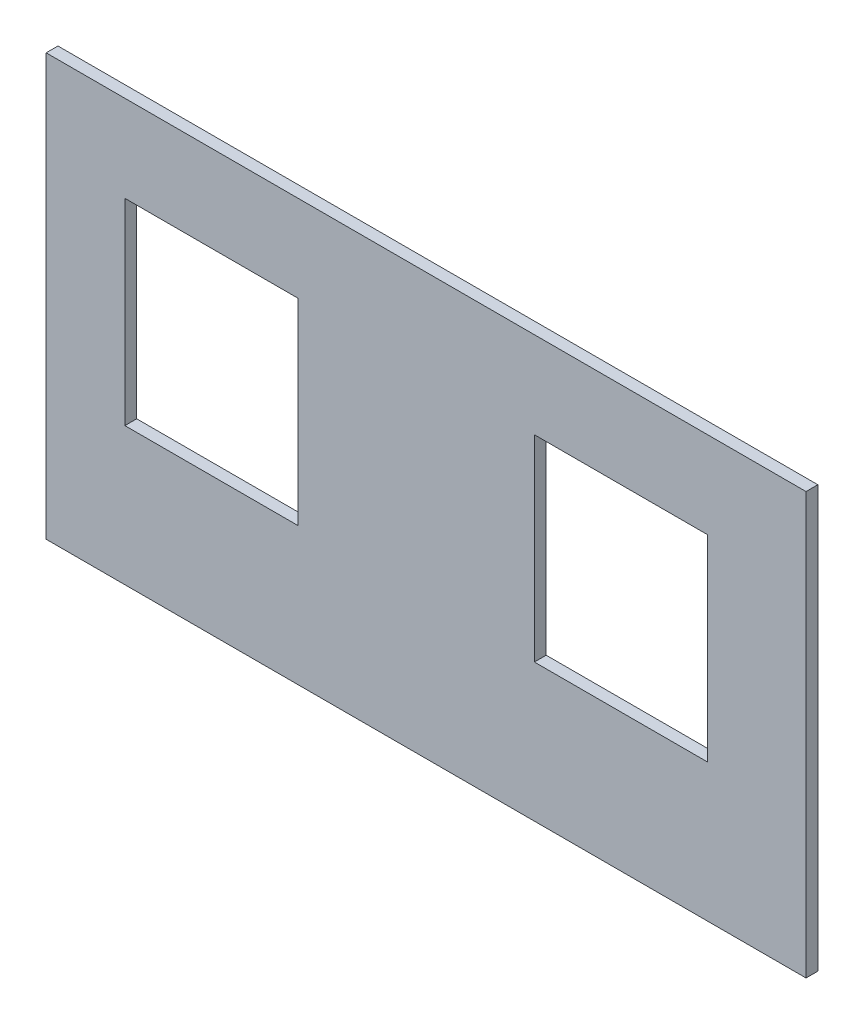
ISO-10303-21;
HEADER;
FILE_DESCRIPTION(('STEP AP214'),'2;1');
FILE_NAME('part.step','',(''),(''),'','','');
FILE_SCHEMA(('AUTOMOTIVE_DESIGN { 1 0 10303 214 1 1 1 1 }'));
ENDSEC;
DATA;
#1=APPLICATION_CONTEXT('core data for automotive mechanical design processes');
#2=APPLICATION_PROTOCOL_DEFINITION('international standard','automotive_design',2000,#1);
#3=PRODUCT_CONTEXT('',#1,'mechanical');
#4=PRODUCT('Part','Part','',(#3));
#5=PRODUCT_RELATED_PRODUCT_CATEGORY('part','',(#4));
#6=PRODUCT_DEFINITION_FORMATION('','',#4);
#7=PRODUCT_DEFINITION_CONTEXT('part definition',#1,'design');
#8=PRODUCT_DEFINITION('design','',#6,#7);
#9=PRODUCT_DEFINITION_SHAPE('','',#8);
#10=(LENGTH_UNIT() NAMED_UNIT(*) SI_UNIT(.MILLI.,.METRE.));
#11=(NAMED_UNIT(*) PLANE_ANGLE_UNIT() SI_UNIT($,.RADIAN.));
#12=(NAMED_UNIT(*) SI_UNIT($,.STERADIAN.) SOLID_ANGLE_UNIT());
#13=UNCERTAINTY_MEASURE_WITH_UNIT(LENGTH_MEASURE(1.E-05),#10,'distance_accuracy_value','');
#14=(GEOMETRIC_REPRESENTATION_CONTEXT(3) GLOBAL_UNCERTAINTY_ASSIGNED_CONTEXT((#13)) GLOBAL_UNIT_ASSIGNED_CONTEXT((#10,
#11,#12)) REPRESENTATION_CONTEXT('',''));
#15=CARTESIAN_POINT('',(0.,0.,0.));
#16=DIRECTION('',(0.,0.,1.));
#17=DIRECTION('',(1.,0.,0.));
#18=AXIS2_PLACEMENT_3D('',#15,#16,#17);
#19=CARTESIAN_POINT('',(0.,0.,3.));
#20=DIRECTION('',(1.,0.,0.));
#21=DIRECTION('',(0.,0.,-1.));
#22=AXIS2_PLACEMENT_3D('',#19,#20,#21);
#23=PLANE('',#22);
#24=DIRECTION('',(0.,-1.,0.));
#25=VECTOR('',#24,1.);
#26=CARTESIAN_POINT('',(0.,0.,0.));
#27=LINE('',#26,#25);
#28=CARTESIAN_POINT('',(0.,107.,0.));
#29=VERTEX_POINT('',#28);
#30=CARTESIAN_POINT('',(0.,0.,0.));
#31=VERTEX_POINT('',#30);
#32=EDGE_CURVE('E181',#29,#31,#27,.T.);
#33=ORIENTED_EDGE('',*,*,#32,.T.);
#34=DIRECTION('',(0.,0.,-1.));
#35=VECTOR('',#34,1.);
#36=CARTESIAN_POINT('',(0.,0.,3.));
#37=LINE('',#36,#35);
#38=CARTESIAN_POINT('',(0.,0.,3.));
#39=VERTEX_POINT('',#38);
#40=EDGE_CURVE('E11',#39,#31,#37,.T.);
#41=ORIENTED_EDGE('',*,*,#40,.F.);
#42=DIRECTION('',(0.,-1.,0.));
#43=VECTOR('',#42,1.);
#44=CARTESIAN_POINT('',(0.,0.,3.));
#45=LINE('',#44,#43);
#46=CARTESIAN_POINT('',(0.,107.,3.));
#47=VERTEX_POINT('',#46);
#48=EDGE_CURVE('E188',#47,#39,#45,.T.);
#49=ORIENTED_EDGE('',*,*,#48,.F.);
#50=DIRECTION('',(0.,0.,-1.));
#51=VECTOR('',#50,1.);
#52=CARTESIAN_POINT('',(0.,107.,3.));
#53=LINE('',#52,#51);
#54=EDGE_CURVE('E198',#47,#29,#53,.T.);
#55=ORIENTED_EDGE('',*,*,#54,.T.);
#56=EDGE_LOOP('',(#33,#41,#49,#55));
#57=FACE_BOUND('',#56,.T.);
#58=ADVANCED_FACE('F31',(#57),#23,.F.);
#59=CARTESIAN_POINT('',(0.,0.,3.));
#60=DIRECTION('',(0.,1.,0.));
#61=DIRECTION('',(0.,0.,1.));
#62=AXIS2_PLACEMENT_3D('',#59,#60,#61);
#63=PLANE('',#62);
#64=DIRECTION('',(1.,0.,0.));
#65=VECTOR('',#64,1.);
#66=CARTESIAN_POINT('',(0.,0.,0.));
#67=LINE('',#66,#65);
#68=CARTESIAN_POINT('',(193.,0.,0.));
#69=VERTEX_POINT('',#68);
#70=EDGE_CURVE('E201',#31,#69,#67,.T.);
#71=ORIENTED_EDGE('',*,*,#70,.T.);
#72=DIRECTION('',(0.,0.,-1.));
#73=VECTOR('',#72,1.);
#74=CARTESIAN_POINT('',(193.,0.,3.));
#75=LINE('',#74,#73);
#76=CARTESIAN_POINT('',(193.,0.,3.));
#77=VERTEX_POINT('',#76);
#78=EDGE_CURVE('E38',#77,#69,#75,.T.);
#79=ORIENTED_EDGE('',*,*,#78,.F.);
#80=DIRECTION('',(1.,0.,0.));
#81=VECTOR('',#80,1.);
#82=CARTESIAN_POINT('',(0.,0.,3.));
#83=LINE('',#82,#81);
#84=EDGE_CURVE('E191',#39,#77,#83,.T.);
#85=ORIENTED_EDGE('',*,*,#84,.F.);
#86=ORIENTED_EDGE('',*,*,#40,.T.);
#87=EDGE_LOOP('',(#71,#79,#85,#86));
#88=FACE_BOUND('',#87,.T.);
#89=ADVANCED_FACE('F230',(#88),#63,.F.);
#90=CARTESIAN_POINT('',(193.,0.,3.));
#91=DIRECTION('',(-1.,0.,0.));
#92=DIRECTION('',(0.,0.,1.));
#93=AXIS2_PLACEMENT_3D('',#90,#91,#92);
#94=PLANE('',#93);
#95=DIRECTION('',(0.,1.,0.));
#96=VECTOR('',#95,1.);
#97=CARTESIAN_POINT('',(193.,0.,0.));
#98=LINE('',#97,#96);
#99=CARTESIAN_POINT('',(193.,107.,0.));
#100=VERTEX_POINT('',#99);
#101=EDGE_CURVE('E203',#69,#100,#98,.T.);
#102=ORIENTED_EDGE('',*,*,#101,.T.);
#103=DIRECTION('',(0.,0.,-1.));
#104=VECTOR('',#103,1.);
#105=CARTESIAN_POINT('',(193.,107.,3.));
#106=LINE('',#105,#104);
#107=CARTESIAN_POINT('',(193.,107.,3.));
#108=VERTEX_POINT('',#107);
#109=EDGE_CURVE('E208',#108,#100,#106,.T.);
#110=ORIENTED_EDGE('',*,*,#109,.F.);
#111=DIRECTION('',(0.,1.,0.));
#112=VECTOR('',#111,1.);
#113=CARTESIAN_POINT('',(193.,0.,3.));
#114=LINE('',#113,#112);
#115=EDGE_CURVE('E194',#77,#108,#114,.T.);
#116=ORIENTED_EDGE('',*,*,#115,.F.);
#117=ORIENTED_EDGE('',*,*,#78,.T.);
#118=EDGE_LOOP('',(#102,#110,#116,#117));
#119=FACE_BOUND('',#118,.T.);
#120=ADVANCED_FACE('F215',(#119),#94,.F.);
#121=CARTESIAN_POINT('',(0.,107.,3.));
#122=DIRECTION('',(0.,-1.,0.));
#123=DIRECTION('',(0.,0.,-1.));
#124=AXIS2_PLACEMENT_3D('',#121,#122,#123);
#125=PLANE('',#124);
#126=DIRECTION('',(-1.,0.,0.));
#127=VECTOR('',#126,1.);
#128=CARTESIAN_POINT('',(0.,107.,0.));
#129=LINE('',#128,#127);
#130=EDGE_CURVE('E192',#100,#29,#129,.T.);
#131=ORIENTED_EDGE('',*,*,#130,.T.);
#132=ORIENTED_EDGE('',*,*,#54,.F.);
#133=DIRECTION('',(-1.,0.,0.));
#134=VECTOR('',#133,1.);
#135=CARTESIAN_POINT('',(0.,107.,3.));
#136=LINE('',#135,#134);
#137=EDGE_CURVE('E196',#108,#47,#136,.T.);
#138=ORIENTED_EDGE('',*,*,#137,.F.);
#139=ORIENTED_EDGE('',*,*,#109,.T.);
#140=EDGE_LOOP('',(#131,#132,#138,#139));
#141=FACE_BOUND('',#140,.T.);
#142=ADVANCED_FACE('F223',(#141),#125,.F.);
#143=CARTESIAN_POINT('',(0.,107.,3.));
#144=DIRECTION('',(0.,0.,-1.));
#145=DIRECTION('',(-1.,0.,0.));
#146=AXIS2_PLACEMENT_3D('',#143,#144,#145);
#147=PLANE('',#146);
#148=DIRECTION('',(1.,0.,0.));
#149=VECTOR('',#148,1.);
#150=CARTESIAN_POINT('',(124.,35.,3.));
#151=LINE('',#150,#149);
#152=CARTESIAN_POINT('',(124.,35.,3.));
#153=VERTEX_POINT('',#152);
#154=CARTESIAN_POINT('',(168.,35.,3.));
#155=VERTEX_POINT('',#154);
#156=EDGE_CURVE('E146',#153,#155,#151,.T.);
#157=ORIENTED_EDGE('',*,*,#156,.F.);
#158=DIRECTION('',(0.,-1.,0.));
#159=VECTOR('',#158,1.);
#160=CARTESIAN_POINT('',(124.,35.,3.));
#161=LINE('',#160,#159);
#162=CARTESIAN_POINT('',(124.,85.,3.));
#163=VERTEX_POINT('',#162);
#164=EDGE_CURVE('E45',#163,#153,#161,.T.);
#165=ORIENTED_EDGE('',*,*,#164,.F.);
#166=DIRECTION('',(-1.,0.,0.));
#167=VECTOR('',#166,1.);
#168=CARTESIAN_POINT('',(124.,85.,3.));
#169=LINE('',#168,#167);
#170=CARTESIAN_POINT('',(168.,85.,3.));
#171=VERTEX_POINT('',#170);
#172=EDGE_CURVE('E137',#171,#163,#169,.T.);
#173=ORIENTED_EDGE('',*,*,#172,.F.);
#174=DIRECTION('',(0.,1.,0.));
#175=VECTOR('',#174,1.);
#176=CARTESIAN_POINT('',(168.,35.,3.));
#177=LINE('',#176,#175);
#178=EDGE_CURVE('E140',#155,#171,#177,.T.);
#179=ORIENTED_EDGE('',*,*,#178,.F.);
#180=EDGE_LOOP('',(#157,#165,#173,#179));
#181=FACE_BOUND('',#180,.T.);
#182=DIRECTION('',(1.,0.,0.));
#183=VECTOR('',#182,1.);
#184=CARTESIAN_POINT('',(20.,35.,3.));
#185=LINE('',#184,#183);
#186=CARTESIAN_POINT('',(20.,35.,3.));
#187=VERTEX_POINT('',#186);
#188=CARTESIAN_POINT('',(64.,35.,3.));
#189=VERTEX_POINT('',#188);
#190=EDGE_CURVE('E171',#187,#189,#185,.T.);
#191=ORIENTED_EDGE('',*,*,#190,.F.);
#192=DIRECTION('',(0.,-1.,0.));
#193=VECTOR('',#192,1.);
#194=CARTESIAN_POINT('',(20.,35.,3.));
#195=LINE('',#194,#193);
#196=CARTESIAN_POINT('',(20.,85.,3.));
#197=VERTEX_POINT('',#196);
#198=EDGE_CURVE('E152',#197,#187,#195,.T.);
#199=ORIENTED_EDGE('',*,*,#198,.F.);
#200=DIRECTION('',(-1.,0.,0.));
#201=VECTOR('',#200,1.);
#202=CARTESIAN_POINT('',(20.,85.,3.));
#203=LINE('',#202,#201);
#204=CARTESIAN_POINT('',(64.,85.,3.));
#205=VERTEX_POINT('',#204);
#206=EDGE_CURVE('E160',#205,#197,#203,.T.);
#207=ORIENTED_EDGE('',*,*,#206,.F.);
#208=DIRECTION('',(0.,1.,0.));
#209=VECTOR('',#208,1.);
#210=CARTESIAN_POINT('',(64.,35.,3.));
#211=LINE('',#210,#209);
#212=EDGE_CURVE('E174',#189,#205,#211,.T.);
#213=ORIENTED_EDGE('',*,*,#212,.F.);
#214=EDGE_LOOP('',(#191,#199,#207,#213));
#215=FACE_BOUND('',#214,.T.);
#216=ORIENTED_EDGE('',*,*,#48,.T.);
#217=ORIENTED_EDGE('',*,*,#84,.T.);
#218=ORIENTED_EDGE('',*,*,#115,.T.);
#219=ORIENTED_EDGE('',*,*,#137,.T.);
#220=EDGE_LOOP('',(#216,#217,#218,#219));
#221=FACE_BOUND('',#220,.T.);
#222=ADVANCED_FACE('F229',(#181,#215,#221),#147,.F.);
#223=CARTESIAN_POINT('',(0.,107.,0.));
#224=DIRECTION('',(0.,0.,-1.));
#225=DIRECTION('',(-1.,0.,0.));
#226=AXIS2_PLACEMENT_3D('',#223,#224,#225);
#227=PLANE('',#226);
#228=DIRECTION('',(0.,-1.,0.));
#229=VECTOR('',#228,1.);
#230=CARTESIAN_POINT('',(124.,35.,0.));
#231=LINE('',#230,#229);
#232=CARTESIAN_POINT('',(124.,85.,0.));
#233=VERTEX_POINT('',#232);
#234=CARTESIAN_POINT('',(124.,35.,0.));
#235=VERTEX_POINT('',#234);
#236=EDGE_CURVE('E121',#233,#235,#231,.T.);
#237=ORIENTED_EDGE('',*,*,#236,.T.);
#238=DIRECTION('',(1.,0.,0.));
#239=VECTOR('',#238,1.);
#240=CARTESIAN_POINT('',(124.,35.,0.));
#241=LINE('',#240,#239);
#242=CARTESIAN_POINT('',(168.,35.,0.));
#243=VERTEX_POINT('',#242);
#244=EDGE_CURVE('E130',#235,#243,#241,.T.);
#245=ORIENTED_EDGE('',*,*,#244,.T.);
#246=DIRECTION('',(0.,1.,0.));
#247=VECTOR('',#246,1.);
#248=CARTESIAN_POINT('',(168.,35.,0.));
#249=LINE('',#248,#247);
#250=CARTESIAN_POINT('',(168.,85.,0.));
#251=VERTEX_POINT('',#250);
#252=EDGE_CURVE('E53',#243,#251,#249,.T.);
#253=ORIENTED_EDGE('',*,*,#252,.T.);
#254=DIRECTION('',(-1.,0.,0.));
#255=VECTOR('',#254,1.);
#256=CARTESIAN_POINT('',(124.,85.,0.));
#257=LINE('',#256,#255);
#258=EDGE_CURVE('E127',#251,#233,#257,.T.);
#259=ORIENTED_EDGE('',*,*,#258,.T.);
#260=EDGE_LOOP('',(#237,#245,#253,#259));
#261=FACE_BOUND('',#260,.T.);
#262=DIRECTION('',(0.,-1.,0.));
#263=VECTOR('',#262,1.);
#264=CARTESIAN_POINT('',(20.,35.,0.));
#265=LINE('',#264,#263);
#266=CARTESIAN_POINT('',(20.,85.,0.));
#267=VERTEX_POINT('',#266);
#268=CARTESIAN_POINT('',(20.,35.,0.));
#269=VERTEX_POINT('',#268);
#270=EDGE_CURVE('E156',#267,#269,#265,.T.);
#271=ORIENTED_EDGE('',*,*,#270,.T.);
#272=DIRECTION('',(1.,0.,0.));
#273=VECTOR('',#272,1.);
#274=CARTESIAN_POINT('',(20.,35.,0.));
#275=LINE('',#274,#273);
#276=CARTESIAN_POINT('',(64.,35.,0.));
#277=VERTEX_POINT('',#276);
#278=EDGE_CURVE('E159',#269,#277,#275,.T.);
#279=ORIENTED_EDGE('',*,*,#278,.T.);
#280=DIRECTION('',(0.,1.,0.));
#281=VECTOR('',#280,1.);
#282=CARTESIAN_POINT('',(64.,35.,0.));
#283=LINE('',#282,#281);
#284=CARTESIAN_POINT('',(64.,85.,0.));
#285=VERTEX_POINT('',#284);
#286=EDGE_CURVE('E163',#277,#285,#283,.T.);
#287=ORIENTED_EDGE('',*,*,#286,.T.);
#288=DIRECTION('',(-1.,0.,0.));
#289=VECTOR('',#288,1.);
#290=CARTESIAN_POINT('',(20.,85.,0.));
#291=LINE('',#290,#289);
#292=EDGE_CURVE('E166',#285,#267,#291,.T.);
#293=ORIENTED_EDGE('',*,*,#292,.T.);
#294=EDGE_LOOP('',(#271,#279,#287,#293));
#295=FACE_BOUND('',#294,.T.);
#296=ORIENTED_EDGE('',*,*,#32,.F.);
#297=ORIENTED_EDGE('',*,*,#130,.F.);
#298=ORIENTED_EDGE('',*,*,#101,.F.);
#299=ORIENTED_EDGE('',*,*,#70,.F.);
#300=EDGE_LOOP('',(#296,#297,#298,#299));
#301=FACE_BOUND('',#300,.T.);
#302=ADVANCED_FACE('F134',(#261,#295,#301),#227,.T.);
#303=CARTESIAN_POINT('',(20.,35.,0.));
#304=DIRECTION('',(-1.,0.,0.));
#305=DIRECTION('',(0.,0.,1.));
#306=AXIS2_PLACEMENT_3D('',#303,#304,#305);
#307=PLANE('',#306);
#308=ORIENTED_EDGE('',*,*,#198,.T.);
#309=DIRECTION('',(0.,0.,1.));
#310=VECTOR('',#309,1.);
#311=CARTESIAN_POINT('',(20.,35.,0.));
#312=LINE('',#311,#310);
#313=EDGE_CURVE('E169',#269,#187,#312,.T.);
#314=ORIENTED_EDGE('',*,*,#313,.F.);
#315=ORIENTED_EDGE('',*,*,#270,.F.);
#316=DIRECTION('',(0.,0.,1.));
#317=VECTOR('',#316,1.);
#318=CARTESIAN_POINT('',(20.,85.,0.));
#319=LINE('',#318,#317);
#320=EDGE_CURVE('E179',#267,#197,#319,.T.);
#321=ORIENTED_EDGE('',*,*,#320,.T.);
#322=EDGE_LOOP('',(#308,#314,#315,#321));
#323=FACE_BOUND('',#322,.T.);
#324=ADVANCED_FACE('F242',(#323),#307,.F.);
#325=CARTESIAN_POINT('',(20.,85.,0.));
#326=DIRECTION('',(0.,1.,0.));
#327=DIRECTION('',(0.,0.,1.));
#328=AXIS2_PLACEMENT_3D('',#325,#326,#327);
#329=PLANE('',#328);
#330=ORIENTED_EDGE('',*,*,#206,.T.);
#331=ORIENTED_EDGE('',*,*,#320,.F.);
#332=ORIENTED_EDGE('',*,*,#292,.F.);
#333=DIRECTION('',(0.,0.,1.));
#334=VECTOR('',#333,1.);
#335=CARTESIAN_POINT('',(64.,85.,0.));
#336=LINE('',#335,#334);
#337=EDGE_CURVE('E182',#285,#205,#336,.T.);
#338=ORIENTED_EDGE('',*,*,#337,.T.);
#339=EDGE_LOOP('',(#330,#331,#332,#338));
#340=FACE_BOUND('',#339,.T.);
#341=ADVANCED_FACE('F248',(#340),#329,.F.);
#342=CARTESIAN_POINT('',(64.,35.,0.));
#343=DIRECTION('',(1.,0.,0.));
#344=DIRECTION('',(0.,0.,-1.));
#345=AXIS2_PLACEMENT_3D('',#342,#343,#344);
#346=PLANE('',#345);
#347=ORIENTED_EDGE('',*,*,#212,.T.);
#348=ORIENTED_EDGE('',*,*,#337,.F.);
#349=ORIENTED_EDGE('',*,*,#286,.F.);
#350=DIRECTION('',(0.,0.,1.));
#351=VECTOR('',#350,1.);
#352=CARTESIAN_POINT('',(64.,35.,0.));
#353=LINE('',#352,#351);
#354=EDGE_CURVE('E184',#277,#189,#353,.T.);
#355=ORIENTED_EDGE('',*,*,#354,.T.);
#356=EDGE_LOOP('',(#347,#348,#349,#355));
#357=FACE_BOUND('',#356,.T.);
#358=ADVANCED_FACE('F253',(#357),#346,.F.);
#359=CARTESIAN_POINT('',(20.,35.,0.));
#360=DIRECTION('',(0.,-1.,0.));
#361=DIRECTION('',(0.,0.,-1.));
#362=AXIS2_PLACEMENT_3D('',#359,#360,#361);
#363=PLANE('',#362);
#364=ORIENTED_EDGE('',*,*,#190,.T.);
#365=ORIENTED_EDGE('',*,*,#354,.F.);
#366=ORIENTED_EDGE('',*,*,#278,.F.);
#367=ORIENTED_EDGE('',*,*,#313,.T.);
#368=EDGE_LOOP('',(#364,#365,#366,#367));
#369=FACE_BOUND('',#368,.T.);
#370=ADVANCED_FACE('F250',(#369),#363,.F.);
#371=CARTESIAN_POINT('',(124.,35.,0.));
#372=DIRECTION('',(-1.,0.,0.));
#373=DIRECTION('',(0.,0.,1.));
#374=AXIS2_PLACEMENT_3D('',#371,#372,#373);
#375=PLANE('',#374);
#376=ORIENTED_EDGE('',*,*,#164,.T.);
#377=DIRECTION('',(0.,0.,1.));
#378=VECTOR('',#377,1.);
#379=CARTESIAN_POINT('',(124.,35.,0.));
#380=LINE('',#379,#378);
#381=EDGE_CURVE('E117',#235,#153,#380,.T.);
#382=ORIENTED_EDGE('',*,*,#381,.F.);
#383=ORIENTED_EDGE('',*,*,#236,.F.);
#384=DIRECTION('',(0.,0.,1.));
#385=VECTOR('',#384,1.);
#386=CARTESIAN_POINT('',(124.,85.,0.));
#387=LINE('',#386,#385);
#388=EDGE_CURVE('E150',#233,#163,#387,.T.);
#389=ORIENTED_EDGE('',*,*,#388,.T.);
#390=EDGE_LOOP('',(#376,#382,#383,#389));
#391=FACE_BOUND('',#390,.T.);
#392=ADVANCED_FACE('F119',(#391),#375,.F.);
#393=CARTESIAN_POINT('',(124.,85.,0.));
#394=DIRECTION('',(0.,1.,0.));
#395=DIRECTION('',(0.,0.,1.));
#396=AXIS2_PLACEMENT_3D('',#393,#394,#395);
#397=PLANE('',#396);
#398=ORIENTED_EDGE('',*,*,#172,.T.);
#399=ORIENTED_EDGE('',*,*,#388,.F.);
#400=ORIENTED_EDGE('',*,*,#258,.F.);
#401=DIRECTION('',(0.,0.,1.));
#402=VECTOR('',#401,1.);
#403=CARTESIAN_POINT('',(168.,85.,0.));
#404=LINE('',#403,#402);
#405=EDGE_CURVE('E153',#251,#171,#404,.T.);
#406=ORIENTED_EDGE('',*,*,#405,.T.);
#407=EDGE_LOOP('',(#398,#399,#400,#406));
#408=FACE_BOUND('',#407,.T.);
#409=ADVANCED_FACE('F263',(#408),#397,.F.);
#410=CARTESIAN_POINT('',(168.,35.,0.));
#411=DIRECTION('',(1.,0.,0.));
#412=DIRECTION('',(0.,0.,-1.));
#413=AXIS2_PLACEMENT_3D('',#410,#411,#412);
#414=PLANE('',#413);
#415=ORIENTED_EDGE('',*,*,#178,.T.);
#416=ORIENTED_EDGE('',*,*,#405,.F.);
#417=ORIENTED_EDGE('',*,*,#252,.F.);
#418=DIRECTION('',(0.,0.,1.));
#419=VECTOR('',#418,1.);
#420=CARTESIAN_POINT('',(168.,35.,0.));
#421=LINE('',#420,#419);
#422=EDGE_CURVE('E126',#243,#155,#421,.T.);
#423=ORIENTED_EDGE('',*,*,#422,.T.);
#424=EDGE_LOOP('',(#415,#416,#417,#423));
#425=FACE_BOUND('',#424,.T.);
#426=ADVANCED_FACE('F266',(#425),#414,.F.);
#427=CARTESIAN_POINT('',(124.,35.,0.));
#428=DIRECTION('',(0.,-1.,0.));
#429=DIRECTION('',(0.,0.,-1.));
#430=AXIS2_PLACEMENT_3D('',#427,#428,#429);
#431=PLANE('',#430);
#432=ORIENTED_EDGE('',*,*,#156,.T.);
#433=ORIENTED_EDGE('',*,*,#422,.F.);
#434=ORIENTED_EDGE('',*,*,#244,.F.);
#435=ORIENTED_EDGE('',*,*,#381,.T.);
#436=EDGE_LOOP('',(#432,#433,#434,#435));
#437=FACE_BOUND('',#436,.T.);
#438=ADVANCED_FACE('F131',(#437),#431,.F.);
#439=CLOSED_SHELL('',(#58,#89,#120,#142,#222,#302,#324,#341,#358,#370,#392,#409,#426,#438));
#440=MANIFOLD_SOLID_BREP('B2',#439);
#441=ADVANCED_BREP_SHAPE_REPRESENTATION('',(#18,#440),#14);
#442=SHAPE_DEFINITION_REPRESENTATION(#9,#441);
ENDSEC;
END-ISO-10303-21;
